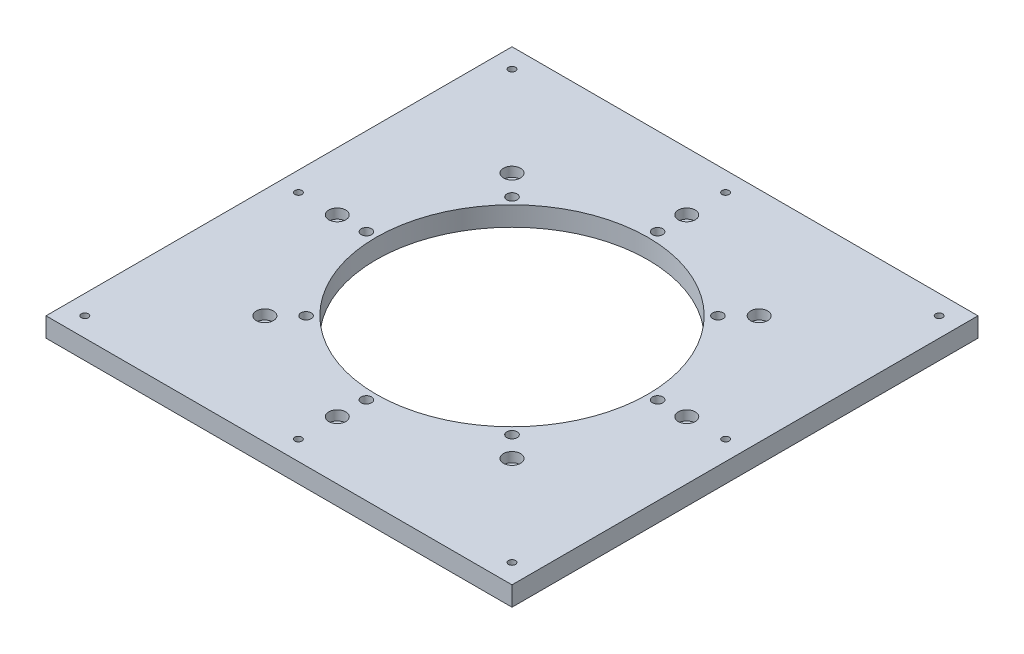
from build123d import *

# Parameters (mm, degrees)
SKETCH2_W                                        = 304.8
SKETCH2_H                                        = 304.8
BOSS_EXTRUDE1_DEPTH                              = 12.7
SKETCH3_R                                        = 88.9
CUT_EXTRUDE1_DEPTH                               = 432.239341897
CIRPATTERN2_COUNT                                = 8
CIRPATTERN3_COUNT                                = 8
CBORE_FOR_1_4_SOCKET_HEAD_CAP_SCREW5_D           = 6.7564
CBORE_FOR_1_4_SOCKET_HEAD_CAP_SCREW5_DEPTH       = 12.0396
CBORE_FOR_1_4_SOCKET_HEAD_CAP_SCREW5_CBORE_D     = 11.1125
CBORE_FOR_1_4_SOCKET_HEAD_CAP_SCREW5_CBORE_DEPTH = 6.35
CBORE_FOR_1_4_SOCKET_HEAD_CAP_SCREW5_TIP         = 2.029827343
CBORE_FOR_1_4_SOCKET_HEAD_CAP_SCREW6_D           = 6.7564
CBORE_FOR_1_4_SOCKET_HEAD_CAP_SCREW6_DEPTH       = 12.0396
CBORE_FOR_1_4_SOCKET_HEAD_CAP_SCREW6_CBORE_D     = 11.1125
CBORE_FOR_1_4_SOCKET_HEAD_CAP_SCREW6_CBORE_DEPTH = 6.35
CBORE_FOR_1_4_SOCKET_HEAD_CAP_SCREW6_TIP         = 2.029827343


with BuildPart() as part:
    # Sketch2 → Boss-Extrude1 (new body)
    with BuildSketch(Plane(origin=(0, 0, 0), x_dir=(1, 0, 0), z_dir=(0, 1, 0))):
        with Locations((-152.4, -152.4)):
            Rectangle(SKETCH2_W, SKETCH2_H)
    extrude(amount=BOSS_EXTRUDE1_DEPTH)

    # Sketch3 → Cut-Extrude1 (cut, through all)
    with BuildSketch(Plane(origin=(0, 12.7, 0), x_dir=(1, 0, 0), z_dir=(0, 1, 0))):
        with Locations(Location((-152.4, -152.4, 0), (0, 0, 270))):
            Circle(SKETCH3_R)
    extrude(amount=-CUT_EXTRUDE1_DEPTH, mode=Mode.SUBTRACT)

    # Sketch7 → CBORE for 1_4 Socket Head Cap Screw2 (revolve, cut)
    with BuildSketch(Plane(origin=(-152.4, 12.7, 38.1), x_dir=(0, 0, 1), z_dir=(1, 0, 0))):
        Polygon((0, 0), (0, 25.931227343), (3.3782, 23.9014), (3.3782, 6.35), (5.55625, 6.35), (5.55625, 0), align=None)
    cbore_for_1_4_socket_head_cap_screw2 = revolve(axis=Axis((-152.4, 19.05, 38.1), (0, -1, 0)), mode=Mode.SUBTRACT)

    # CirPattern2: CBORE for 1_4 Socket Head Cap Screw2 ×8 about axis
    cirpattern2_axis = Axis((-152.4, 0, 152.4), (0, 1, 0))
    for i in range(1, CIRPATTERN2_COUNT):
        add(cbore_for_1_4_socket_head_cap_screw2.rotate(cirpattern2_axis, i * 360 / CIRPATTERN2_COUNT), mode=Mode.SUBTRACT)

    # Sketch9 → CBORE for 1_4 Socket Head Cap Screw3 (revolve, cut)
    with BuildSketch(Plane(origin=(-152.4, 0, 57.15), x_dir=(0, 0, -1), z_dir=(1, 0, 0))):
        Polygon((0, 0), (0, 25.931227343), (3.3782, 23.9014), (3.3782, 6.35), (5.55625, 6.35), (5.55625, 0), align=None)
    cbore_for_1_4_socket_head_cap_screw3 = revolve(axis=Axis((-152.4, -6.35, 57.15), (0, 1, 0)), mode=Mode.SUBTRACT)

    # CirPattern3: CBORE for 1_4 Socket Head Cap Screw3 ×8 about axis
    cirpattern3_axis = Axis((-152.4, 0, 152.4), (0, 1, 0))
    for i in range(1, CIRPATTERN3_COUNT):
        add(cbore_for_1_4_socket_head_cap_screw3.rotate(cirpattern3_axis, i * 360 / CIRPATTERN3_COUNT), mode=Mode.SUBTRACT)

    # CBORE for 1_4 Socket Head Cap Screw5
    with Locations(Plane(origin=(0, 0, 0), x_dir=(-1, 0, 0), z_dir=(0, -1, 0))):
        with Locations((292.1, -292.1), (152.4, -292.1), (12.7, -292.1), (12.7, -152.4), (12.7, -12.7)):
            CounterBoreHole(CBORE_FOR_1_4_SOCKET_HEAD_CAP_SCREW5_D / 2, CBORE_FOR_1_4_SOCKET_HEAD_CAP_SCREW5_CBORE_D / 2, CBORE_FOR_1_4_SOCKET_HEAD_CAP_SCREW5_CBORE_DEPTH, depth=CBORE_FOR_1_4_SOCKET_HEAD_CAP_SCREW5_DEPTH)
            with Locations((0, 0, -(CBORE_FOR_1_4_SOCKET_HEAD_CAP_SCREW5_DEPTH + CBORE_FOR_1_4_SOCKET_HEAD_CAP_SCREW5_TIP / 2))):  # 118° drill point
                Cone(0, CBORE_FOR_1_4_SOCKET_HEAD_CAP_SCREW5_D / 2, CBORE_FOR_1_4_SOCKET_HEAD_CAP_SCREW5_TIP, mode=Mode.SUBTRACT)

    # CBORE for 1_4 Socket Head Cap Screw6
    with Locations(Plane(origin=(0, 0, 0), x_dir=(-1, 0, 0), z_dir=(0, -1, 0))):
        with Locations((292.1, -152.4), (292.1, -12.7), (152.4, -12.7)):
            CounterBoreHole(CBORE_FOR_1_4_SOCKET_HEAD_CAP_SCREW6_D / 2, CBORE_FOR_1_4_SOCKET_HEAD_CAP_SCREW6_CBORE_D / 2, CBORE_FOR_1_4_SOCKET_HEAD_CAP_SCREW6_CBORE_DEPTH, depth=CBORE_FOR_1_4_SOCKET_HEAD_CAP_SCREW6_DEPTH)
            with Locations((0, 0, -(CBORE_FOR_1_4_SOCKET_HEAD_CAP_SCREW6_DEPTH + CBORE_FOR_1_4_SOCKET_HEAD_CAP_SCREW6_TIP / 2))):  # 118° drill point
                Cone(0, CBORE_FOR_1_4_SOCKET_HEAD_CAP_SCREW6_D / 2, CBORE_FOR_1_4_SOCKET_HEAD_CAP_SCREW6_TIP, mode=Mode.SUBTRACT)


solid = part.part
